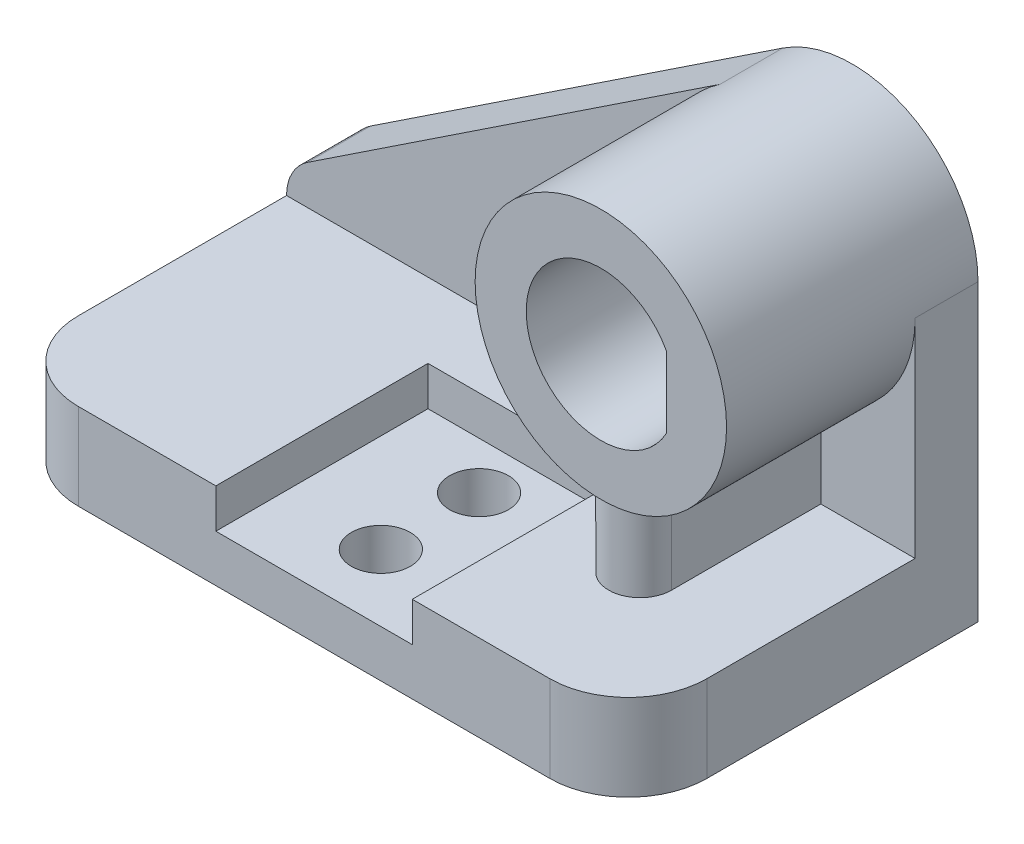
ISO-10303-21;
HEADER;
FILE_DESCRIPTION(('STEP AP214'),'2;1');
FILE_NAME('part.step','',(''),(''),'','','');
FILE_SCHEMA(('AUTOMOTIVE_DESIGN { 1 0 10303 214 1 1 1 1 }'));
ENDSEC;
DATA;
#1=APPLICATION_CONTEXT('core data for automotive mechanical design processes');
#2=APPLICATION_PROTOCOL_DEFINITION('international standard','automotive_design',2000,#1);
#3=PRODUCT_CONTEXT('',#1,'mechanical');
#4=PRODUCT('Part','Part','',(#3));
#5=PRODUCT_RELATED_PRODUCT_CATEGORY('part','',(#4));
#6=PRODUCT_DEFINITION_FORMATION('','',#4);
#7=PRODUCT_DEFINITION_CONTEXT('part definition',#1,'design');
#8=PRODUCT_DEFINITION('design','',#6,#7);
#9=PRODUCT_DEFINITION_SHAPE('','',#8);
#10=(LENGTH_UNIT() NAMED_UNIT(*) SI_UNIT(.MILLI.,.METRE.));
#11=(NAMED_UNIT(*) PLANE_ANGLE_UNIT() SI_UNIT($,.RADIAN.));
#12=(NAMED_UNIT(*) SI_UNIT($,.STERADIAN.) SOLID_ANGLE_UNIT());
#13=UNCERTAINTY_MEASURE_WITH_UNIT(LENGTH_MEASURE(1.E-05),#10,'distance_accuracy_value','');
#14=(GEOMETRIC_REPRESENTATION_CONTEXT(3) GLOBAL_UNCERTAINTY_ASSIGNED_CONTEXT((#13)) GLOBAL_UNIT_ASSIGNED_CONTEXT((#10,
#11,#12)) REPRESENTATION_CONTEXT('',''));
#15=CARTESIAN_POINT('',(0.,0.,0.));
#16=DIRECTION('',(0.,0.,1.));
#17=DIRECTION('',(1.,0.,0.));
#18=AXIS2_PLACEMENT_3D('',#15,#16,#17);
#19=CARTESIAN_POINT('',(0.,22.,0.));
#20=DIRECTION('',(0.,1.,0.));
#21=DIRECTION('',(0.,0.,1.));
#22=AXIS2_PLACEMENT_3D('',#19,#20,#21);
#23=PLANE('',#22);
#24=DIRECTION('',(1.,0.,0.));
#25=VECTOR('',#24,1.);
#26=CARTESIAN_POINT('',(0.,22.,0.));
#27=LINE('',#26,#25);
#28=CARTESIAN_POINT('',(20.,22.,0.));
#29=VERTEX_POINT('',#28);
#30=CARTESIAN_POINT('',(55.,22.,0.));
#31=VERTEX_POINT('',#30);
#32=EDGE_CURVE('E345',#29,#31,#27,.T.);
#33=ORIENTED_EDGE('',*,*,#32,.T.);
#34=DIRECTION('',(0.,0.,-1.));
#35=VECTOR('',#34,1.);
#36=CARTESIAN_POINT('',(55.,22.,0.));
#37=LINE('',#36,#35);
#38=CARTESIAN_POINT('',(55.,22.,-54.));
#39=VERTEX_POINT('',#38);
#40=EDGE_CURVE('E183',#31,#39,#37,.T.);
#41=ORIENTED_EDGE('',*,*,#40,.T.);
#42=DIRECTION('',(1.,0.,0.));
#43=VECTOR('',#42,1.);
#44=CARTESIAN_POINT('',(55.,22.,-54.));
#45=LINE('',#44,#43);
#46=CARTESIAN_POINT('',(105.,22.,-54.));
#47=VERTEX_POINT('',#46);
#48=EDGE_CURVE('E332',#39,#47,#45,.T.);
#49=ORIENTED_EDGE('',*,*,#48,.T.);
#50=DIRECTION('',(0.,0.,-1.));
#51=VECTOR('',#50,1.);
#52=CARTESIAN_POINT('',(105.,22.,0.));
#53=LINE('',#52,#51);
#54=CARTESIAN_POINT('',(105.,22.,0.));
#55=VERTEX_POINT('',#54);
#56=EDGE_CURVE('E322',#55,#47,#53,.T.);
#57=ORIENTED_EDGE('',*,*,#56,.F.);
#58=CARTESIAN_POINT('',(140.,22.,0.));
#59=VERTEX_POINT('',#58);
#60=EDGE_CURVE('E188',#55,#59,#27,.T.);
#61=ORIENTED_EDGE('',*,*,#60,.T.);
#62=CARTESIAN_POINT('',(140.,22.,-20.));
#63=DIRECTION('',(0.,1.,0.));
#64=DIRECTION('',(0.,0.,1.));
#65=AXIS2_PLACEMENT_3D('',#62,#63,#64);
#66=CIRCLE('',#65,20.);
#67=CARTESIAN_POINT('',(160.,22.,-20.));
#68=VERTEX_POINT('',#67);
#69=EDGE_CURVE('E303',#59,#68,#66,.T.);
#70=ORIENTED_EDGE('',*,*,#69,.T.);
#71=DIRECTION('',(0.,0.,-1.));
#72=VECTOR('',#71,1.);
#73=CARTESIAN_POINT('',(160.,22.,-89.));
#74=LINE('',#73,#72);
#75=CARTESIAN_POINT('',(160.,22.,-73.));
#76=VERTEX_POINT('',#75);
#77=EDGE_CURVE('E368',#68,#76,#74,.T.);
#78=ORIENTED_EDGE('',*,*,#77,.T.);
#79=DIRECTION('',(-1.,0.,0.));
#80=VECTOR('',#79,1.);
#81=CARTESIAN_POINT('',(160.,22.,-73.));
#82=LINE('',#81,#80);
#83=CARTESIAN_POINT('',(136.,22.,-73.));
#84=VERTEX_POINT('',#83);
#85=EDGE_CURVE('E414',#76,#84,#82,.T.);
#86=ORIENTED_EDGE('',*,*,#85,.T.);
#87=DIRECTION('',(0.,0.,-1.));
#88=VECTOR('',#87,1.);
#89=CARTESIAN_POINT('',(136.,22.,-35.));
#90=LINE('',#89,#88);
#91=CARTESIAN_POINT('',(136.,21.9999999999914,-35.));
#92=VERTEX_POINT('',#91);
#93=EDGE_CURVE('E216',#92,#84,#90,.T.);
#94=ORIENTED_EDGE('',*,*,#93,.F.);
#95=CARTESIAN_POINT('',(128.,22.,-35.));
#96=DIRECTION('',(0.,1.,0.));
#97=DIRECTION('',(0.,0.,1.));
#98=AXIS2_PLACEMENT_3D('',#95,#96,#97);
#99=CIRCLE('',#98,8.00000000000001);
#100=CARTESIAN_POINT('',(120.,22.,-35.));
#101=VERTEX_POINT('',#100);
#102=EDGE_CURVE('E213',#101,#92,#99,.T.);
#103=ORIENTED_EDGE('',*,*,#102,.F.);
#104=DIRECTION('',(0.,0.,1.));
#105=VECTOR('',#104,1.);
#106=CARTESIAN_POINT('',(120.,22.,-73.));
#107=LINE('',#106,#105);
#108=CARTESIAN_POINT('',(120.,22.,-73.));
#109=VERTEX_POINT('',#108);
#110=EDGE_CURVE('E208',#109,#101,#107,.T.);
#111=ORIENTED_EDGE('',*,*,#110,.F.);
#112=CARTESIAN_POINT('',(0.,22.,-73.));
#113=VERTEX_POINT('',#112);
#114=EDGE_CURVE('E399',#109,#113,#82,.T.);
#115=ORIENTED_EDGE('',*,*,#114,.T.);
#116=DIRECTION('',(0.,0.,1.));
#117=VECTOR('',#116,1.);
#118=CARTESIAN_POINT('',(0.,22.,0.));
#119=LINE('',#118,#117);
#120=CARTESIAN_POINT('',(0.,22.,-20.));
#121=VERTEX_POINT('',#120);
#122=EDGE_CURVE('E388',#113,#121,#119,.T.);
#123=ORIENTED_EDGE('',*,*,#122,.T.);
#124=CARTESIAN_POINT('',(20.,22.,-20.));
#125=DIRECTION('',(0.,1.,0.));
#126=DIRECTION('',(0.,0.,1.));
#127=AXIS2_PLACEMENT_3D('',#124,#125,#126);
#128=CIRCLE('',#127,20.);
#129=EDGE_CURVE('E310',#121,#29,#128,.T.);
#130=ORIENTED_EDGE('',*,*,#129,.T.);
#131=EDGE_LOOP('',(#33,#41,#49,#57,#61,#70,#78,#86,#94,#103,#111,#115,#123,#130));
#132=FACE_BOUND('',#131,.T.);
#133=ADVANCED_FACE('F32',(#132),#23,.T.);
#134=CARTESIAN_POINT('',(0.,22.,0.));
#135=DIRECTION('',(0.,0.,-1.));
#136=DIRECTION('',(-1.,0.,0.));
#137=AXIS2_PLACEMENT_3D('',#134,#135,#136);
#138=PLANE('',#137);
#139=DIRECTION('',(0.,1.,0.));
#140=VECTOR('',#139,1.);
#141=CARTESIAN_POINT('',(55.,12.,0.));
#142=LINE('',#141,#140);
#143=CARTESIAN_POINT('',(55.,12.,0.));
#144=VERTEX_POINT('',#143);
#145=EDGE_CURVE('E203',#144,#31,#142,.T.);
#146=ORIENTED_EDGE('',*,*,#145,.T.);
#147=ORIENTED_EDGE('',*,*,#32,.F.);
#148=DIRECTION('',(0.,-1.,0.));
#149=VECTOR('',#148,1.);
#150=CARTESIAN_POINT('',(20.,22.,0.));
#151=LINE('',#150,#149);
#152=CARTESIAN_POINT('',(20.,0.,0.));
#153=VERTEX_POINT('',#152);
#154=EDGE_CURVE('E377',#29,#153,#151,.T.);
#155=ORIENTED_EDGE('',*,*,#154,.T.);
#156=DIRECTION('',(1.,0.,0.));
#157=VECTOR('',#156,1.);
#158=CARTESIAN_POINT('',(0.,0.,0.));
#159=LINE('',#158,#157);
#160=CARTESIAN_POINT('',(140.,0.,0.));
#161=VERTEX_POINT('',#160);
#162=EDGE_CURVE('E366',#153,#161,#159,.T.);
#163=ORIENTED_EDGE('',*,*,#162,.T.);
#164=DIRECTION('',(0.,-1.,0.));
#165=VECTOR('',#164,1.);
#166=CARTESIAN_POINT('',(140.,22.,0.));
#167=LINE('',#166,#165);
#168=EDGE_CURVE('E304',#161,#59,#167,.F.);
#169=ORIENTED_EDGE('',*,*,#168,.T.);
#170=ORIENTED_EDGE('',*,*,#60,.F.);
#171=DIRECTION('',(0.,1.,0.));
#172=VECTOR('',#171,1.);
#173=CARTESIAN_POINT('',(105.,12.,0.));
#174=LINE('',#173,#172);
#175=CARTESIAN_POINT('',(105.,12.,0.));
#176=VERTEX_POINT('',#175);
#177=EDGE_CURVE('E173',#176,#55,#174,.T.);
#178=ORIENTED_EDGE('',*,*,#177,.F.);
#179=DIRECTION('',(1.,0.,0.));
#180=VECTOR('',#179,1.);
#181=CARTESIAN_POINT('',(55.,12.,0.));
#182=LINE('',#181,#180);
#183=EDGE_CURVE('E177',#144,#176,#182,.T.);
#184=ORIENTED_EDGE('',*,*,#183,.F.);
#185=EDGE_LOOP('',(#146,#147,#155,#163,#169,#170,#178,#184));
#186=FACE_BOUND('',#185,.T.);
#187=ADVANCED_FACE('F186',(#186),#138,.F.);
#188=CARTESIAN_POINT('',(128.,75.,-73.));
#189=DIRECTION('',(0.,0.,-1.));
#190=DIRECTION('',(-1.,0.,0.));
#191=AXIS2_PLACEMENT_3D('',#188,#189,#190);
#192=CYLINDRICAL_SURFACE('',#191,32.);
#193=CARTESIAN_POINT('',(128.,75.,-25.));
#194=DIRECTION('',(0.,0.,-1.));
#195=DIRECTION('',(-1.,0.,0.));
#196=AXIS2_PLACEMENT_3D('',#193,#194,#195);
#197=CIRCLE('',#196,32.);
#198=CARTESIAN_POINT('',(96.,75.,-25.));
#199=VERTEX_POINT('',#198);
#200=EDGE_CURVE('E406',#199,#199,#197,.T.);
#201=ORIENTED_EDGE('',*,*,#200,.T.);
#202=EDGE_LOOP('',(#201));
#203=FACE_BOUND('',#202,.T.);
#204=CARTESIAN_POINT('',(136.,44.0161332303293,-35.));
#205=CARTESIAN_POINT('',(136.000028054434,44.0161587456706,-34.7787632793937));
#206=CARTESIAN_POINT('',(135.990823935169,44.0137645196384,-34.5575354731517));
#207=CARTESIAN_POINT('',(135.954157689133,44.0043223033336,-34.1167341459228));
#208=CARTESIAN_POINT('',(135.926698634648,43.9972750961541,-33.897160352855));
#209=CARTESIAN_POINT('',(135.853800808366,43.9787308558,-33.4616585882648));
#210=CARTESIAN_POINT('',(135.808397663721,43.9672426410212,-33.2457242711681));
#211=CARTESIAN_POINT('',(135.699997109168,43.9401676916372,-32.8185811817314));
#212=CARTESIAN_POINT('',(135.636999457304,43.9245809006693,-32.6073724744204));
#213=CARTESIAN_POINT('',(135.493935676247,43.8897712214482,-32.1912044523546));
#214=CARTESIAN_POINT('',(135.413874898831,43.8705494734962,-31.9862432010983));
#215=CARTESIAN_POINT('',(135.237254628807,43.8290139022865,-31.5837954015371));
#216=CARTESIAN_POINT('',(135.140689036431,43.8066989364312,-31.3863116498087));
#217=CARTESIAN_POINT('',(134.931780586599,43.7596114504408,-31.0001741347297));
#218=CARTESIAN_POINT('',(134.81943714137,43.7348388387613,-30.8115207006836));
#219=CARTESIAN_POINT('',(134.579753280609,43.6835209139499,-30.4442414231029));
#220=CARTESIAN_POINT('',(134.452412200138,43.6569755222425,-30.2656160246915));
#221=CARTESIAN_POINT('',(134.180936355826,43.6022999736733,-29.9161090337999));
#222=CARTESIAN_POINT('',(134.036520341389,43.5741489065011,-29.7454491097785));
#223=CARTESIAN_POINT('',(133.733946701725,43.5175360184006,-29.416834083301));
#224=CARTESIAN_POINT('',(133.575788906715,43.4890741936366,-29.2588791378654));
#225=CARTESIAN_POINT('',(133.246739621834,43.4326183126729,-28.956687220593));
#226=CARTESIAN_POINT('',(133.075845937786,43.4046243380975,-28.8124526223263));
#227=CARTESIAN_POINT('',(132.722465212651,43.349877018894,-28.5387095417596));
#228=CARTESIAN_POINT('',(132.539978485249,43.3231236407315,-28.4092006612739));
#229=CARTESIAN_POINT('',(132.161932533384,43.2712239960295,-28.1640813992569));
#230=CARTESIAN_POINT('',(131.966224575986,43.2461059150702,-28.0486942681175));
#231=CARTESIAN_POINT('',(131.56551345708,43.1986195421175,-27.8348995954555));
#232=CARTESIAN_POINT('',(131.360513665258,43.1762502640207,-27.7364859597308));
#233=CARTESIAN_POINT('',(130.942582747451,43.1348890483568,-27.5573596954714));
#234=CARTESIAN_POINT('',(130.729651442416,43.1158971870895,-27.4766474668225));
#235=CARTESIAN_POINT('',(130.297399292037,43.0818398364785,-27.3335941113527));
#236=CARTESIAN_POINT('',(130.078078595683,43.0667742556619,-27.2712525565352));
#237=CARTESIAN_POINT('',(129.639162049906,43.0412689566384,-27.1665450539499));
#238=CARTESIAN_POINT('',(129.419661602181,43.0307417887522,-27.1238003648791));
#239=CARTESIAN_POINT('',(128.977688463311,43.0141746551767,-27.0568218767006));
#240=CARTESIAN_POINT('',(128.755215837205,43.0081345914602,-27.0325876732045));
#241=CARTESIAN_POINT('',(128.308967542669,43.0007135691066,-27.0028417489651));
#242=CARTESIAN_POINT('',(128.085192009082,42.9993321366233,-26.9973281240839));
#243=CARTESIAN_POINT('',(127.637987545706,43.0012665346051,-27.0050667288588));
#244=CARTESIAN_POINT('',(127.414558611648,43.0045823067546,-27.0183187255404));
#245=CARTESIAN_POINT('',(126.974700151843,43.015690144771,-27.0629646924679));
#246=CARTESIAN_POINT('',(126.758225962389,43.0233802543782,-27.0939455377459));
#247=CARTESIAN_POINT('',(126.328649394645,43.04295330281,-27.1734861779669));
#248=CARTESIAN_POINT('',(126.115548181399,43.0548376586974,-27.2220519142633));
#249=CARTESIAN_POINT('',(125.694337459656,43.0824741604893,-27.3363503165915));
#250=CARTESIAN_POINT('',(125.486226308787,43.0982250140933,-27.4020772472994));
#251=CARTESIAN_POINT('',(125.076246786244,43.1331831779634,-27.5502218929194));
#252=CARTESIAN_POINT('',(124.874380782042,43.152391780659,-27.6326458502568));
#253=CARTESIAN_POINT('',(124.476575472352,43.1939341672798,-27.8143399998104));
#254=CARTESIAN_POINT('',(124.280702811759,43.2162936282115,-27.9137501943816));
#255=CARTESIAN_POINT('',(123.897943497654,43.2634227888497,-28.1282260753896));
#256=CARTESIAN_POINT('',(123.71105996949,43.2881933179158,-28.2432971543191));
#257=CARTESIAN_POINT('',(123.347545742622,43.3394825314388,-28.4882640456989));
#258=CARTESIAN_POINT('',(123.170914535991,43.3660011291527,-28.6181591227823));
#259=CARTESIAN_POINT('',(122.828998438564,43.4200901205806,-28.8919145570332));
#260=CARTESIAN_POINT('',(122.663713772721,43.4476605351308,-29.0357751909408));
#261=CARTESIAN_POINT('',(122.34120003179,43.5038811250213,-29.3406231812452));
#262=CARTESIAN_POINT('',(122.184311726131,43.5325402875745,-29.5019696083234));
#263=CARTESIAN_POINT('',(121.884694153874,43.5893921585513,-29.8372902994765));
#264=CARTESIAN_POINT('',(121.741960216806,43.6175850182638,-30.0112603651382));
#265=CARTESIAN_POINT('',(121.471476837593,43.6727362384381,-30.3708496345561));
#266=CARTESIAN_POINT('',(121.343737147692,43.6996937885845,-30.5564763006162));
#267=CARTESIAN_POINT('',(121.104301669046,43.7515704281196,-30.9379756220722));
#268=CARTESIAN_POINT('',(120.99259970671,43.7764903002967,-31.1338442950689));
#269=CARTESIAN_POINT('',(120.78540787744,43.8237105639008,-31.5357441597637));
#270=CARTESIAN_POINT('',(120.690016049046,43.84599488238,-31.7418278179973));
#271=CARTESIAN_POINT('',(120.517029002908,43.8870918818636,-32.1615760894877));
#272=CARTESIAN_POINT('',(120.439426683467,43.9059059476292,-32.3752376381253));
#273=CARTESIAN_POINT('',(120.302684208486,43.9394737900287,-32.8084546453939));
#274=CARTESIAN_POINT('',(120.243524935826,43.9542317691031,-33.0280037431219));
#275=CARTESIAN_POINT('',(120.144091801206,43.979243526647,-33.4714978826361));
#276=CARTESIAN_POINT('',(120.103809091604,43.989499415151,-33.6954408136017));
#277=CARTESIAN_POINT('',(120.048780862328,44.0035684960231,-34.0996119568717));
#278=CARTESIAN_POINT('',(120.030482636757,44.0082740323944,-34.2793341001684));
#279=CARTESIAN_POINT('',(120.006096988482,44.0145591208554,-34.6393658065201));
#280=CARTESIAN_POINT('',(119.99998980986,44.0161437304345,-34.8196739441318));
#281=CARTESIAN_POINT('',(120.,44.0161332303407,-34.9999999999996));
#282=B_SPLINE_CURVE_WITH_KNOTS('',3,(#204,#205,#206,#207,#208,#209,#210,#211,#212,#213,#214,
#215,#216,#217,#218,#219,#220,#221,#222,#223,#224,#225,#226,#227,#228,#229,#230,#231,#232,#233,
#234,#235,#236,#237,#238,#239,#240,#241,#242,#243,#244,#245,#246,#247,#248,#249,#250,#251,#252,
#253,#254,#255,#256,#257,#258,#259,#260,#261,#262,#263,#264,#265,#266,#267,#268,#269,#270,#271,
#272,#273,#274,#275,#276,#277,#278,#279,#280,#281),.UNSPECIFIED.,.F.,.F.,(4,2,2,2,2,2,2,2,2,2,2,
2,2,2,2,2,2,2,2,2,2,2,2,2,2,2,2,2,2,2,2,2,2,2,2,2,2,2,4),(0.,0.66349224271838,1.32687284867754,
1.98894290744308,2.65102207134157,3.31289388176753,3.97501083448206,4.63715245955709,
5.29932345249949,5.97452992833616,6.64974474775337,7.3250761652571,8.00038931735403,
8.68528336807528,9.36993099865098,10.0545940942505,10.7392412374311,11.4100321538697,
12.0808084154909,12.7515164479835,13.4222161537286,14.0778887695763,14.7337831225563,
15.3894585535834,16.0453795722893,16.7069934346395,17.3688356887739,18.0306451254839,
18.6924676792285,19.372267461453,20.0518421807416,20.7318564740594,21.4116082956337,
22.0953124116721,22.7787431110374,23.4614630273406,24.143862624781,24.6855747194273,
25.2264082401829),.UNSPECIFIED.);
#283=CARTESIAN_POINT('',(136.,44.0161332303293,-35.));
#284=VERTEX_POINT('',#283);
#285=CARTESIAN_POINT('',(120.,44.0161332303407,-35.));
#286=VERTEX_POINT('',#285);
#287=EDGE_CURVE('E233',#284,#286,#282,.T.);
#288=ORIENTED_EDGE('',*,*,#287,.F.);
#289=DIRECTION('',(0.,0.,-1.));
#290=VECTOR('',#289,1.);
#291=CARTESIAN_POINT('',(136.,44.0161332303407,-73.));
#292=LINE('',#291,#290);
#293=CARTESIAN_POINT('',(136.,44.0161332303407,-73.));
#294=VERTEX_POINT('',#293);
#295=EDGE_CURVE('E230',#294,#284,#292,.F.);
#296=ORIENTED_EDGE('',*,*,#295,.F.);
#297=CARTESIAN_POINT('',(128.,75.,-73.));
#298=DIRECTION('',(0.,0.,-1.));
#299=DIRECTION('',(-1.,0.,0.));
#300=AXIS2_PLACEMENT_3D('',#297,#298,#299);
#301=CIRCLE('',#300,32.);
#302=CARTESIAN_POINT('',(160.,75.,-73.));
#303=VERTEX_POINT('',#302);
#304=EDGE_CURVE('E11',#303,#294,#301,.T.);
#305=ORIENTED_EDGE('',*,*,#304,.F.);
#306=DIRECTION('',(0.,0.,-1.));
#307=VECTOR('',#306,1.);
#308=CARTESIAN_POINT('',(160.,75.,-73.));
#309=LINE('',#308,#307);
#310=CARTESIAN_POINT('',(160.,75.,-89.));
#311=VERTEX_POINT('',#310);
#312=EDGE_CURVE('E361',#303,#311,#309,.T.);
#313=ORIENTED_EDGE('',*,*,#312,.T.);
#314=CARTESIAN_POINT('',(128.,75.,-89.));
#315=DIRECTION('',(0.,0.,-1.));
#316=DIRECTION('',(-1.,0.,0.));
#317=AXIS2_PLACEMENT_3D('',#314,#315,#316);
#318=CIRCLE('',#317,32.);
#319=CARTESIAN_POINT('',(110.301754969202,101.660309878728,-89.));
#320=VERTEX_POINT('',#319);
#321=EDGE_CURVE('E396',#320,#311,#318,.T.);
#322=ORIENTED_EDGE('',*,*,#321,.F.);
#323=DIRECTION('',(0.,0.,-1.));
#324=VECTOR('',#323,1.);
#325=CARTESIAN_POINT('',(110.301754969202,101.660309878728,-73.));
#326=LINE('',#325,#324);
#327=CARTESIAN_POINT('',(110.301754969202,101.660309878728,-73.));
#328=VERTEX_POINT('',#327);
#329=EDGE_CURVE('E392',#328,#320,#326,.T.);
#330=ORIENTED_EDGE('',*,*,#329,.F.);
#331=CARTESIAN_POINT('',(120.,44.0161332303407,-73.));
#332=VERTEX_POINT('',#331);
#333=EDGE_CURVE('E41',#332,#328,#301,.T.);
#334=ORIENTED_EDGE('',*,*,#333,.F.);
#335=DIRECTION('',(0.,0.,-1.));
#336=VECTOR('',#335,1.);
#337=CARTESIAN_POINT('',(120.,44.0161332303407,-73.));
#338=LINE('',#337,#336);
#339=EDGE_CURVE('E242',#286,#332,#338,.T.);
#340=ORIENTED_EDGE('',*,*,#339,.F.);
#341=EDGE_LOOP('',(#288,#296,#305,#313,#322,#330,#334,#340));
#342=FACE_BOUND('',#341,.T.);
#343=ADVANCED_FACE('F261',(#203,#342),#192,.T.);
#344=CARTESIAN_POINT('',(12.,22.,-73.));
#345=DIRECTION('',(0.,0.,-1.));
#346=DIRECTION('',(-1.,0.,0.));
#347=AXIS2_PLACEMENT_3D('',#344,#345,#346);
#348=PLANE('',#347);
#349=DIRECTION('',(0.,-1.,0.));
#350=VECTOR('',#349,1.);
#351=CARTESIAN_POINT('',(136.,500000.,-73.));
#352=LINE('',#351,#350);
#353=EDGE_CURVE('E219',#294,#84,#352,.T.);
#354=ORIENTED_EDGE('',*,*,#353,.T.);
#355=ORIENTED_EDGE('',*,*,#85,.F.);
#356=DIRECTION('',(0.,-1.,0.));
#357=VECTOR('',#356,1.);
#358=CARTESIAN_POINT('',(160.,22.,-73.));
#359=LINE('',#358,#357);
#360=EDGE_CURVE('E386',#303,#76,#359,.T.);
#361=ORIENTED_EDGE('',*,*,#360,.F.);
#362=ORIENTED_EDGE('',*,*,#304,.T.);
#363=EDGE_LOOP('',(#354,#355,#361,#362));
#364=FACE_BOUND('',#363,.T.);
#365=ADVANCED_FACE('F257',(#364),#348,.F.);
#366=DIRECTION('',(0.,-1.,0.));
#367=VECTOR('',#366,1.);
#368=CARTESIAN_POINT('',(120.,500000.,-73.));
#369=LINE('',#368,#367);
#370=EDGE_CURVE('E227',#332,#109,#369,.T.);
#371=ORIENTED_EDGE('',*,*,#370,.F.);
#372=ORIENTED_EDGE('',*,*,#333,.T.);
#373=DIRECTION('',(0.833134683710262,0.553070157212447,0.));
#374=VECTOR('',#373,1.);
#375=CARTESIAN_POINT('',(5.36315811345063,31.9976162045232,-73.));
#376=LINE('',#375,#374);
#377=CARTESIAN_POINT('',(5.36315811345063,31.9976162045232,-73.));
#378=VERTEX_POINT('',#377);
#379=EDGE_CURVE('E408',#378,#328,#376,.T.);
#380=ORIENTED_EDGE('',*,*,#379,.F.);
#381=CARTESIAN_POINT('',(12.,22.,-73.));
#382=DIRECTION('',(0.,0.,-1.));
#383=DIRECTION('',(-1.,0.,0.));
#384=AXIS2_PLACEMENT_3D('',#381,#382,#383);
#385=CIRCLE('',#384,12.);
#386=EDGE_CURVE('E411',#113,#378,#385,.T.);
#387=ORIENTED_EDGE('',*,*,#386,.F.);
#388=ORIENTED_EDGE('',*,*,#114,.F.);
#389=EDGE_LOOP('',(#371,#372,#380,#387,#388));
#390=FACE_BOUND('',#389,.T.);
#391=ADVANCED_FACE('F260',(#390),#348,.F.);
#392=CARTESIAN_POINT('',(160.,22.,-89.));
#393=DIRECTION('',(-1.,0.,0.));
#394=DIRECTION('',(0.,0.,1.));
#395=AXIS2_PLACEMENT_3D('',#392,#393,#394);
#396=PLANE('',#395);
#397=ORIENTED_EDGE('',*,*,#77,.F.);
#398=DIRECTION('',(0.,-1.,0.));
#399=VECTOR('',#398,1.);
#400=CARTESIAN_POINT('',(160.,22.,-20.));
#401=LINE('',#400,#399);
#402=CARTESIAN_POINT('',(160.,0.,-20.));
#403=VERTEX_POINT('',#402);
#404=EDGE_CURVE('E306',#68,#403,#401,.T.);
#405=ORIENTED_EDGE('',*,*,#404,.T.);
#406=DIRECTION('',(0.,0.,-1.));
#407=VECTOR('',#406,1.);
#408=CARTESIAN_POINT('',(160.,0.,-89.));
#409=LINE('',#408,#407);
#410=CARTESIAN_POINT('',(160.,0.,-89.));
#411=VERTEX_POINT('',#410);
#412=EDGE_CURVE('E358',#403,#411,#409,.T.);
#413=ORIENTED_EDGE('',*,*,#412,.T.);
#414=DIRECTION('',(0.,-1.,0.));
#415=VECTOR('',#414,1.);
#416=CARTESIAN_POINT('',(160.,22.,-89.));
#417=LINE('',#416,#415);
#418=EDGE_CURVE('E352',#311,#411,#417,.T.);
#419=ORIENTED_EDGE('',*,*,#418,.F.);
#420=ORIENTED_EDGE('',*,*,#312,.F.);
#421=ORIENTED_EDGE('',*,*,#360,.T.);
#422=EDGE_LOOP('',(#397,#405,#413,#419,#420,#421));
#423=FACE_BOUND('',#422,.T.);
#424=ADVANCED_FACE('F290',(#423),#396,.F.);
#425=CARTESIAN_POINT('',(0.,22.,-89.));
#426=DIRECTION('',(0.,0.,1.));
#427=DIRECTION('',(1.,0.,0.));
#428=AXIS2_PLACEMENT_3D('',#425,#426,#427);
#429=PLANE('',#428);
#430=DIRECTION('',(0.,1.,0.));
#431=VECTOR('',#430,1.);
#432=CARTESIAN_POINT('',(144.733200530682,84.,-89.));
#433=LINE('',#432,#431);
#434=CARTESIAN_POINT('',(144.733200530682,66.,-89.));
#435=VERTEX_POINT('',#434);
#436=CARTESIAN_POINT('',(144.733200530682,84.,-89.));
#437=VERTEX_POINT('',#436);
#438=EDGE_CURVE('E196',#435,#437,#433,.T.);
#439=ORIENTED_EDGE('',*,*,#438,.T.);
#440=CARTESIAN_POINT('',(128.,75.,-89.));
#441=DIRECTION('',(0.,0.,1.));
#442=DIRECTION('',(1.,0.,0.));
#443=AXIS2_PLACEMENT_3D('',#440,#441,#442);
#444=CIRCLE('',#443,19.);
#445=EDGE_CURVE('E57',#437,#435,#444,.T.);
#446=ORIENTED_EDGE('',*,*,#445,.T.);
#447=EDGE_LOOP('',(#439,#446));
#448=FACE_BOUND('',#447,.T.);
#449=DIRECTION('',(0.833134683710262,0.553070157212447,0.));
#450=VECTOR('',#449,1.);
#451=CARTESIAN_POINT('',(5.36315811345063,31.9976162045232,-89.));
#452=LINE('',#451,#450);
#453=CARTESIAN_POINT('',(5.36315811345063,31.9976162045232,-89.));
#454=VERTEX_POINT('',#453);
#455=EDGE_CURVE('E400',#454,#320,#452,.T.);
#456=ORIENTED_EDGE('',*,*,#455,.T.);
#457=ORIENTED_EDGE('',*,*,#321,.T.);
#458=ORIENTED_EDGE('',*,*,#418,.T.);
#459=DIRECTION('',(-1.,0.,0.));
#460=VECTOR('',#459,1.);
#461=CARTESIAN_POINT('',(0.,0.,-89.));
#462=LINE('',#461,#460);
#463=CARTESIAN_POINT('',(0.,0.,-89.));
#464=VERTEX_POINT('',#463);
#465=EDGE_CURVE('E360',#411,#464,#462,.T.);
#466=ORIENTED_EDGE('',*,*,#465,.T.);
#467=DIRECTION('',(0.,-1.,0.));
#468=VECTOR('',#467,1.);
#469=CARTESIAN_POINT('',(0.,22.,-89.));
#470=LINE('',#469,#468);
#471=CARTESIAN_POINT('',(0.,22.,-89.));
#472=VERTEX_POINT('',#471);
#473=EDGE_CURVE('E349',#472,#464,#470,.T.);
#474=ORIENTED_EDGE('',*,*,#473,.F.);
#475=CARTESIAN_POINT('',(12.,22.,-89.));
#476=DIRECTION('',(0.,0.,-1.));
#477=DIRECTION('',(-1.,0.,0.));
#478=AXIS2_PLACEMENT_3D('',#475,#476,#477);
#479=CIRCLE('',#478,12.);
#480=EDGE_CURVE('E403',#472,#454,#479,.T.);
#481=ORIENTED_EDGE('',*,*,#480,.T.);
#482=EDGE_LOOP('',(#456,#457,#458,#466,#474,#481));
#483=FACE_BOUND('',#482,.T.);
#484=ADVANCED_FACE('F286',(#448,#483),#429,.F.);
#485=CARTESIAN_POINT('',(0.,22.,0.));
#486=DIRECTION('',(1.,0.,0.));
#487=DIRECTION('',(0.,0.,-1.));
#488=AXIS2_PLACEMENT_3D('',#485,#486,#487);
#489=PLANE('',#488);
#490=DIRECTION('',(0.,0.,1.));
#491=VECTOR('',#490,1.);
#492=CARTESIAN_POINT('',(0.,0.,0.));
#493=LINE('',#492,#491);
#494=CARTESIAN_POINT('',(0.,0.,-20.));
#495=VERTEX_POINT('',#494);
#496=EDGE_CURVE('E363',#464,#495,#493,.T.);
#497=ORIENTED_EDGE('',*,*,#496,.T.);
#498=DIRECTION('',(0.,-1.,0.));
#499=VECTOR('',#498,1.);
#500=CARTESIAN_POINT('',(0.,22.,-20.));
#501=LINE('',#500,#499);
#502=EDGE_CURVE('E309',#495,#121,#501,.F.);
#503=ORIENTED_EDGE('',*,*,#502,.T.);
#504=ORIENTED_EDGE('',*,*,#122,.F.);
#505=EDGE_CURVE('E354',#472,#113,#119,.T.);
#506=ORIENTED_EDGE('',*,*,#505,.F.);
#507=ORIENTED_EDGE('',*,*,#473,.T.);
#508=EDGE_LOOP('',(#497,#503,#504,#506,#507));
#509=FACE_BOUND('',#508,.T.);
#510=ADVANCED_FACE('F280',(#509),#489,.F.);
#511=CARTESIAN_POINT('',(0.,0.,0.));
#512=DIRECTION('',(0.,1.,0.));
#513=DIRECTION('',(0.,0.,1.));
#514=AXIS2_PLACEMENT_3D('',#511,#512,#513);
#515=PLANE('',#514);
#516=CARTESIAN_POINT('',(80.,0.,-17.));
#517=DIRECTION('',(0.,1.,0.));
#518=DIRECTION('',(0.,0.,1.));
#519=AXIS2_PLACEMENT_3D('',#516,#517,#518);
#520=CIRCLE('',#519,7.5);
#521=CARTESIAN_POINT('',(80.,0.,-9.50000000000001));
#522=VERTEX_POINT('',#521);
#523=EDGE_CURVE('E318',#522,#522,#520,.T.);
#524=ORIENTED_EDGE('',*,*,#523,.T.);
#525=EDGE_LOOP('',(#524));
#526=FACE_BOUND('',#525,.T.);
#527=CARTESIAN_POINT('',(80.,0.,-42.));
#528=DIRECTION('',(0.,1.,0.));
#529=DIRECTION('',(0.,0.,1.));
#530=AXIS2_PLACEMENT_3D('',#527,#528,#529);
#531=CIRCLE('',#530,7.5);
#532=CARTESIAN_POINT('',(80.,0.,-34.5));
#533=VERTEX_POINT('',#532);
#534=EDGE_CURVE('E324',#533,#533,#531,.T.);
#535=ORIENTED_EDGE('',*,*,#534,.T.);
#536=EDGE_LOOP('',(#535));
#537=FACE_BOUND('',#536,.T.);
#538=ORIENTED_EDGE('',*,*,#412,.F.);
#539=CARTESIAN_POINT('',(140.,0.,-20.));
#540=DIRECTION('',(0.,1.,0.));
#541=DIRECTION('',(0.,0.,1.));
#542=AXIS2_PLACEMENT_3D('',#539,#540,#541);
#543=CIRCLE('',#542,20.);
#544=EDGE_CURVE('E375',#403,#161,#543,.F.);
#545=ORIENTED_EDGE('',*,*,#544,.T.);
#546=ORIENTED_EDGE('',*,*,#162,.F.);
#547=CARTESIAN_POINT('',(20.,0.,-20.));
#548=DIRECTION('',(0.,1.,0.));
#549=DIRECTION('',(0.,0.,1.));
#550=AXIS2_PLACEMENT_3D('',#547,#548,#549);
#551=CIRCLE('',#550,20.);
#552=EDGE_CURVE('E373',#153,#495,#551,.F.);
#553=ORIENTED_EDGE('',*,*,#552,.T.);
#554=ORIENTED_EDGE('',*,*,#496,.F.);
#555=ORIENTED_EDGE('',*,*,#465,.F.);
#556=EDGE_LOOP('',(#538,#545,#546,#553,#554,#555));
#557=FACE_BOUND('',#556,.T.);
#558=ADVANCED_FACE('F276',(#526,#537,#557),#515,.F.);
#559=CARTESIAN_POINT('',(140.,22.,-20.));
#560=DIRECTION('',(0.,-1.,0.));
#561=DIRECTION('',(0.,0.,-1.));
#562=AXIS2_PLACEMENT_3D('',#559,#560,#561);
#563=CYLINDRICAL_SURFACE('',#562,20.);
#564=ORIENTED_EDGE('',*,*,#69,.F.);
#565=ORIENTED_EDGE('',*,*,#168,.F.);
#566=ORIENTED_EDGE('',*,*,#544,.F.);
#567=ORIENTED_EDGE('',*,*,#404,.F.);
#568=EDGE_LOOP('',(#564,#565,#566,#567));
#569=FACE_BOUND('',#568,.T.);
#570=ADVANCED_FACE('F279',(#569),#563,.T.);
#571=CARTESIAN_POINT('',(20.,22.,-20.));
#572=DIRECTION('',(0.,-1.,0.));
#573=DIRECTION('',(0.,0.,-1.));
#574=AXIS2_PLACEMENT_3D('',#571,#572,#573);
#575=CYLINDRICAL_SURFACE('',#574,20.);
#576=ORIENTED_EDGE('',*,*,#129,.F.);
#577=ORIENTED_EDGE('',*,*,#502,.F.);
#578=ORIENTED_EDGE('',*,*,#552,.F.);
#579=ORIENTED_EDGE('',*,*,#154,.F.);
#580=EDGE_LOOP('',(#576,#577,#578,#579));
#581=FACE_BOUND('',#580,.T.);
#582=ADVANCED_FACE('F34',(#581),#575,.T.);
#583=CARTESIAN_POINT('',(5.36315811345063,31.9976162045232,-73.));
#584=DIRECTION('',(-0.553070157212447,0.833134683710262,0.));
#585=DIRECTION('',(-0.833134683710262,-0.553070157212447,0.));
#586=AXIS2_PLACEMENT_3D('',#583,#584,#585);
#587=PLANE('',#586);
#588=ORIENTED_EDGE('',*,*,#455,.F.);
#589=DIRECTION('',(0.,0.,-1.));
#590=VECTOR('',#589,1.);
#591=CARTESIAN_POINT('',(5.36315811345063,31.9976162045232,-73.));
#592=LINE('',#591,#590);
#593=EDGE_CURVE('E390',#378,#454,#592,.T.);
#594=ORIENTED_EDGE('',*,*,#593,.F.);
#595=ORIENTED_EDGE('',*,*,#379,.T.);
#596=ORIENTED_EDGE('',*,*,#329,.T.);
#597=EDGE_LOOP('',(#588,#594,#595,#596));
#598=FACE_BOUND('',#597,.T.);
#599=ADVANCED_FACE('F266',(#598),#587,.T.);
#600=CARTESIAN_POINT('',(12.,22.,-73.));
#601=DIRECTION('',(0.,0.,-1.));
#602=DIRECTION('',(-1.,0.,0.));
#603=AXIS2_PLACEMENT_3D('',#600,#601,#602);
#604=CYLINDRICAL_SURFACE('',#603,12.);
#605=ORIENTED_EDGE('',*,*,#480,.F.);
#606=ORIENTED_EDGE('',*,*,#505,.T.);
#607=ORIENTED_EDGE('',*,*,#386,.T.);
#608=ORIENTED_EDGE('',*,*,#593,.T.);
#609=EDGE_LOOP('',(#605,#606,#607,#608));
#610=FACE_BOUND('',#609,.T.);
#611=ADVANCED_FACE('F255',(#610),#604,.T.);
#612=CARTESIAN_POINT('',(128.,75.,-25.));
#613=DIRECTION('',(0.,0.,-1.));
#614=DIRECTION('',(-1.,0.,0.));
#615=AXIS2_PLACEMENT_3D('',#612,#613,#614);
#616=PLANE('',#615);
#617=DIRECTION('',(0.,1.,0.));
#618=VECTOR('',#617,1.);
#619=CARTESIAN_POINT('',(144.733200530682,84.,-25.));
#620=LINE('',#619,#618);
#621=CARTESIAN_POINT('',(144.733200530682,66.,-25.));
#622=VERTEX_POINT('',#621);
#623=CARTESIAN_POINT('',(144.733200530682,84.,-25.));
#624=VERTEX_POINT('',#623);
#625=EDGE_CURVE('E197',#622,#624,#620,.T.);
#626=ORIENTED_EDGE('',*,*,#625,.F.);
#627=CARTESIAN_POINT('',(128.,75.,-25.));
#628=DIRECTION('',(0.,0.,1.));
#629=DIRECTION('',(1.,0.,0.));
#630=AXIS2_PLACEMENT_3D('',#627,#628,#629);
#631=CIRCLE('',#630,19.);
#632=EDGE_CURVE('E201',#624,#622,#631,.T.);
#633=ORIENTED_EDGE('',*,*,#632,.F.);
#634=EDGE_LOOP('',(#626,#633));
#635=FACE_BOUND('',#634,.T.);
#636=ORIENTED_EDGE('',*,*,#200,.F.);
#637=EDGE_LOOP('',(#636));
#638=FACE_BOUND('',#637,.T.);
#639=ADVANCED_FACE('F251',(#635,#638),#616,.F.);
#640=CARTESIAN_POINT('',(136.,500000.,-35.));
#641=DIRECTION('',(-1.,0.,0.));
#642=DIRECTION('',(0.,0.,1.));
#643=AXIS2_PLACEMENT_3D('',#640,#641,#642);
#644=PLANE('',#643);
#645=ORIENTED_EDGE('',*,*,#353,.F.);
#646=ORIENTED_EDGE('',*,*,#295,.T.);
#647=DIRECTION('',(0.,-1.,0.));
#648=VECTOR('',#647,1.);
#649=CARTESIAN_POINT('',(136.,500000.,-35.));
#650=LINE('',#649,#648);
#651=EDGE_CURVE('E221',#284,#92,#650,.T.);
#652=ORIENTED_EDGE('',*,*,#651,.T.);
#653=ORIENTED_EDGE('',*,*,#93,.T.);
#654=EDGE_LOOP('',(#645,#646,#652,#653));
#655=FACE_BOUND('',#654,.T.);
#656=ADVANCED_FACE('F254',(#655),#644,.F.);
#657=CARTESIAN_POINT('',(128.,500000.,-35.));
#658=DIRECTION('',(0.,-1.,0.));
#659=DIRECTION('',(0.,0.,-1.));
#660=AXIS2_PLACEMENT_3D('',#657,#658,#659);
#661=CYLINDRICAL_SURFACE('',#660,8.00000000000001);
#662=ORIENTED_EDGE('',*,*,#651,.F.);
#663=ORIENTED_EDGE('',*,*,#287,.T.);
#664=DIRECTION('',(0.,-1.,0.));
#665=VECTOR('',#664,1.);
#666=CARTESIAN_POINT('',(120.,500000.,-35.));
#667=LINE('',#666,#665);
#668=EDGE_CURVE('E224',#286,#101,#667,.T.);
#669=ORIENTED_EDGE('',*,*,#668,.T.);
#670=ORIENTED_EDGE('',*,*,#102,.T.);
#671=EDGE_LOOP('',(#662,#663,#669,#670));
#672=FACE_BOUND('',#671,.T.);
#673=ADVANCED_FACE('F244',(#672),#661,.T.);
#674=CARTESIAN_POINT('',(120.,500000.,-73.));
#675=DIRECTION('',(1.,0.,0.));
#676=DIRECTION('',(0.,0.,-1.));
#677=AXIS2_PLACEMENT_3D('',#674,#675,#676);
#678=PLANE('',#677);
#679=ORIENTED_EDGE('',*,*,#668,.F.);
#680=ORIENTED_EDGE('',*,*,#339,.T.);
#681=ORIENTED_EDGE('',*,*,#370,.T.);
#682=ORIENTED_EDGE('',*,*,#110,.T.);
#683=EDGE_LOOP('',(#679,#680,#681,#682));
#684=FACE_BOUND('',#683,.T.);
#685=ADVANCED_FACE('F250',(#684),#678,.F.);
#686=CARTESIAN_POINT('',(128.,75.,-89.));
#687=DIRECTION('',(0.,0.,1.));
#688=DIRECTION('',(1.,0.,0.));
#689=AXIS2_PLACEMENT_3D('',#686,#687,#688);
#690=CYLINDRICAL_SURFACE('',#689,19.);
#691=ORIENTED_EDGE('',*,*,#632,.T.);
#692=DIRECTION('',(0.,0.,1.));
#693=VECTOR('',#692,1.);
#694=CARTESIAN_POINT('',(144.733200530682,66.,-89.));
#695=LINE('',#694,#693);
#696=EDGE_CURVE('E200',#435,#622,#695,.T.);
#697=ORIENTED_EDGE('',*,*,#696,.F.);
#698=ORIENTED_EDGE('',*,*,#445,.F.);
#699=DIRECTION('',(0.,0.,1.));
#700=VECTOR('',#699,1.);
#701=CARTESIAN_POINT('',(144.733200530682,84.,-89.));
#702=LINE('',#701,#700);
#703=EDGE_CURVE('E206',#437,#624,#702,.T.);
#704=ORIENTED_EDGE('',*,*,#703,.T.);
#705=EDGE_LOOP('',(#691,#697,#698,#704));
#706=FACE_BOUND('',#705,.T.);
#707=ADVANCED_FACE('F514',(#706),#690,.F.);
#708=CARTESIAN_POINT('',(144.733200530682,84.,-89.));
#709=DIRECTION('',(1.,0.,0.));
#710=DIRECTION('',(0.,0.,-1.));
#711=AXIS2_PLACEMENT_3D('',#708,#709,#710);
#712=PLANE('',#711);
#713=ORIENTED_EDGE('',*,*,#625,.T.);
#714=ORIENTED_EDGE('',*,*,#703,.F.);
#715=ORIENTED_EDGE('',*,*,#438,.F.);
#716=ORIENTED_EDGE('',*,*,#696,.T.);
#717=EDGE_LOOP('',(#713,#714,#715,#716));
#718=FACE_BOUND('',#717,.T.);
#719=ADVANCED_FACE('F508',(#718),#712,.F.);
#720=CARTESIAN_POINT('',(55.,12.,0.));
#721=DIRECTION('',(1.,0.,0.));
#722=DIRECTION('',(0.,0.,-1.));
#723=AXIS2_PLACEMENT_3D('',#720,#721,#722);
#724=PLANE('',#723);
#725=ORIENTED_EDGE('',*,*,#40,.F.);
#726=ORIENTED_EDGE('',*,*,#145,.F.);
#727=DIRECTION('',(0.,0.,-1.));
#728=VECTOR('',#727,1.);
#729=CARTESIAN_POINT('',(55.,12.,0.));
#730=LINE('',#729,#728);
#731=CARTESIAN_POINT('',(55.,12.,-54.));
#732=VERTEX_POINT('',#731);
#733=EDGE_CURVE('E49',#144,#732,#730,.T.);
#734=ORIENTED_EDGE('',*,*,#733,.T.);
#735=DIRECTION('',(0.,1.,0.));
#736=VECTOR('',#735,1.);
#737=CARTESIAN_POINT('',(55.,12.,-54.));
#738=LINE('',#737,#736);
#739=EDGE_CURVE('E190',#732,#39,#738,.T.);
#740=ORIENTED_EDGE('',*,*,#739,.T.);
#741=EDGE_LOOP('',(#725,#726,#734,#740));
#742=FACE_BOUND('',#741,.T.);
#743=ADVANCED_FACE('F340',(#742),#724,.T.);
#744=CARTESIAN_POINT('',(55.,12.,-54.));
#745=DIRECTION('',(0.,0.,1.));
#746=DIRECTION('',(1.,0.,0.));
#747=AXIS2_PLACEMENT_3D('',#744,#745,#746);
#748=PLANE('',#747);
#749=ORIENTED_EDGE('',*,*,#48,.F.);
#750=ORIENTED_EDGE('',*,*,#739,.F.);
#751=DIRECTION('',(1.,0.,0.));
#752=VECTOR('',#751,1.);
#753=CARTESIAN_POINT('',(55.,12.,-54.));
#754=LINE('',#753,#752);
#755=CARTESIAN_POINT('',(105.,12.,-54.));
#756=VERTEX_POINT('',#755);
#757=EDGE_CURVE('E176',#732,#756,#754,.T.);
#758=ORIENTED_EDGE('',*,*,#757,.T.);
#759=DIRECTION('',(0.,1.,0.));
#760=VECTOR('',#759,1.);
#761=CARTESIAN_POINT('',(105.,12.,-54.));
#762=LINE('',#761,#760);
#763=EDGE_CURVE('E175',#756,#47,#762,.T.);
#764=ORIENTED_EDGE('',*,*,#763,.T.);
#765=EDGE_LOOP('',(#749,#750,#758,#764));
#766=FACE_BOUND('',#765,.T.);
#767=ADVANCED_FACE('F342',(#766),#748,.T.);
#768=CARTESIAN_POINT('',(105.,12.,0.));
#769=DIRECTION('',(1.,0.,0.));
#770=DIRECTION('',(0.,0.,-1.));
#771=AXIS2_PLACEMENT_3D('',#768,#769,#770);
#772=PLANE('',#771);
#773=ORIENTED_EDGE('',*,*,#56,.T.);
#774=ORIENTED_EDGE('',*,*,#763,.F.);
#775=DIRECTION('',(0.,0.,-1.));
#776=VECTOR('',#775,1.);
#777=CARTESIAN_POINT('',(105.,12.,0.));
#778=LINE('',#777,#776);
#779=EDGE_CURVE('E169',#176,#756,#778,.T.);
#780=ORIENTED_EDGE('',*,*,#779,.F.);
#781=ORIENTED_EDGE('',*,*,#177,.T.);
#782=EDGE_LOOP('',(#773,#774,#780,#781));
#783=FACE_BOUND('',#782,.T.);
#784=ADVANCED_FACE('F171',(#783),#772,.F.);
#785=CARTESIAN_POINT('',(0.,12.,0.));
#786=DIRECTION('',(0.,1.,0.));
#787=DIRECTION('',(0.,0.,1.));
#788=AXIS2_PLACEMENT_3D('',#785,#786,#787);
#789=PLANE('',#788);
#790=CARTESIAN_POINT('',(80.,12.,-17.));
#791=DIRECTION('',(0.,1.,0.));
#792=DIRECTION('',(0.,0.,1.));
#793=AXIS2_PLACEMENT_3D('',#790,#791,#792);
#794=CIRCLE('',#793,7.5);
#795=CARTESIAN_POINT('',(80.,12.,-9.50000000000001));
#796=VERTEX_POINT('',#795);
#797=EDGE_CURVE('E36',#796,#796,#794,.T.);
#798=ORIENTED_EDGE('',*,*,#797,.F.);
#799=EDGE_LOOP('',(#798));
#800=FACE_BOUND('',#799,.T.);
#801=CARTESIAN_POINT('',(80.,12.,-42.));
#802=DIRECTION('',(0.,1.,0.));
#803=DIRECTION('',(0.,0.,1.));
#804=AXIS2_PLACEMENT_3D('',#801,#802,#803);
#805=CIRCLE('',#804,7.5);
#806=CARTESIAN_POINT('',(80.,12.,-34.5));
#807=VERTEX_POINT('',#806);
#808=EDGE_CURVE('E316',#807,#807,#805,.T.);
#809=ORIENTED_EDGE('',*,*,#808,.F.);
#810=EDGE_LOOP('',(#809));
#811=FACE_BOUND('',#810,.T.);
#812=ORIENTED_EDGE('',*,*,#183,.T.);
#813=ORIENTED_EDGE('',*,*,#779,.T.);
#814=ORIENTED_EDGE('',*,*,#757,.F.);
#815=ORIENTED_EDGE('',*,*,#733,.F.);
#816=EDGE_LOOP('',(#812,#813,#814,#815));
#817=FACE_BOUND('',#816,.T.);
#818=ADVANCED_FACE('F180',(#800,#811,#817),#789,.T.);
#819=CARTESIAN_POINT('',(80.,0.,-42.));
#820=DIRECTION('',(0.,1.,0.));
#821=DIRECTION('',(0.,0.,1.));
#822=AXIS2_PLACEMENT_3D('',#819,#820,#821);
#823=CYLINDRICAL_SURFACE('',#822,7.5);
#824=ORIENTED_EDGE('',*,*,#808,.T.);
#825=EDGE_LOOP('',(#824));
#826=FACE_BOUND('',#825,.T.);
#827=ORIENTED_EDGE('',*,*,#534,.F.);
#828=EDGE_LOOP('',(#827));
#829=FACE_BOUND('',#828,.T.);
#830=ADVANCED_FACE('F481',(#826,#829),#823,.F.);
#831=CARTESIAN_POINT('',(80.,0.,-17.));
#832=DIRECTION('',(0.,1.,0.));
#833=DIRECTION('',(0.,0.,1.));
#834=AXIS2_PLACEMENT_3D('',#831,#832,#833);
#835=CYLINDRICAL_SURFACE('',#834,7.5);
#836=ORIENTED_EDGE('',*,*,#797,.T.);
#837=EDGE_LOOP('',(#836));
#838=FACE_BOUND('',#837,.T.);
#839=ORIENTED_EDGE('',*,*,#523,.F.);
#840=EDGE_LOOP('',(#839));
#841=FACE_BOUND('',#840,.T.);
#842=ADVANCED_FACE('F491',(#838,#841),#835,.F.);
#843=CLOSED_SHELL('',(#133,#187,#343,#365,#391,#424,#484,#510,#558,#570,#582,#599,#611,#639,
#656,#673,#685,#707,#719,#743,#767,#784,#818,#830,#842));
#844=MANIFOLD_SOLID_BREP('B2',#843);
#845=ADVANCED_BREP_SHAPE_REPRESENTATION('',(#18,#844),#14);
#846=SHAPE_DEFINITION_REPRESENTATION(#9,#845);
ENDSEC;
END-ISO-10303-21;
